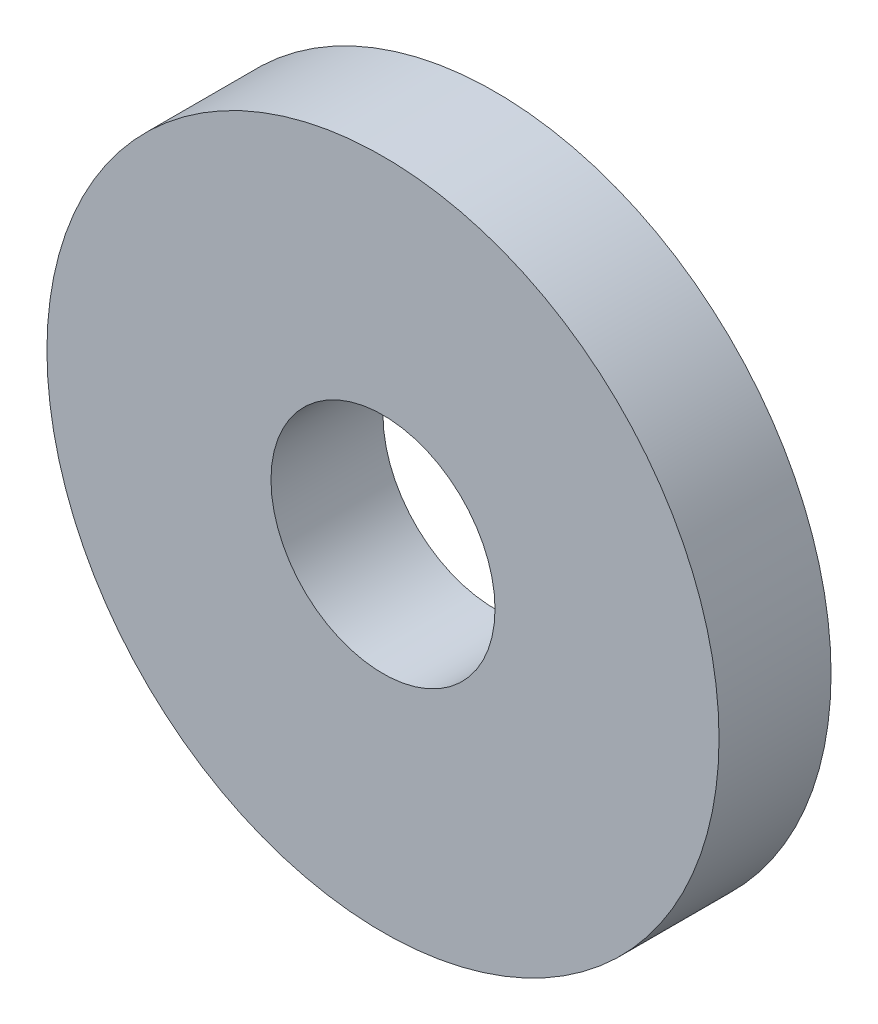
from build123d import *

# Parameters (mm, degrees)
SKETCH1_R           = 9.525
SKETCH1_R_2         = 3.175
BOSS_EXTRUDE1_DEPTH = 3.175


with BuildPart() as part:
    # Sketch1 → Boss-Extrude1 (new body)
    with BuildSketch(Plane.XY):
        with Locations((-51.284459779, 26.439397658)):
            Circle(SKETCH1_R)
        with Locations((-51.284459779, 26.439397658)):
            Circle(SKETCH1_R_2, mode=Mode.SUBTRACT)
    extrude(amount=BOSS_EXTRUDE1_DEPTH)


solid = part.part
